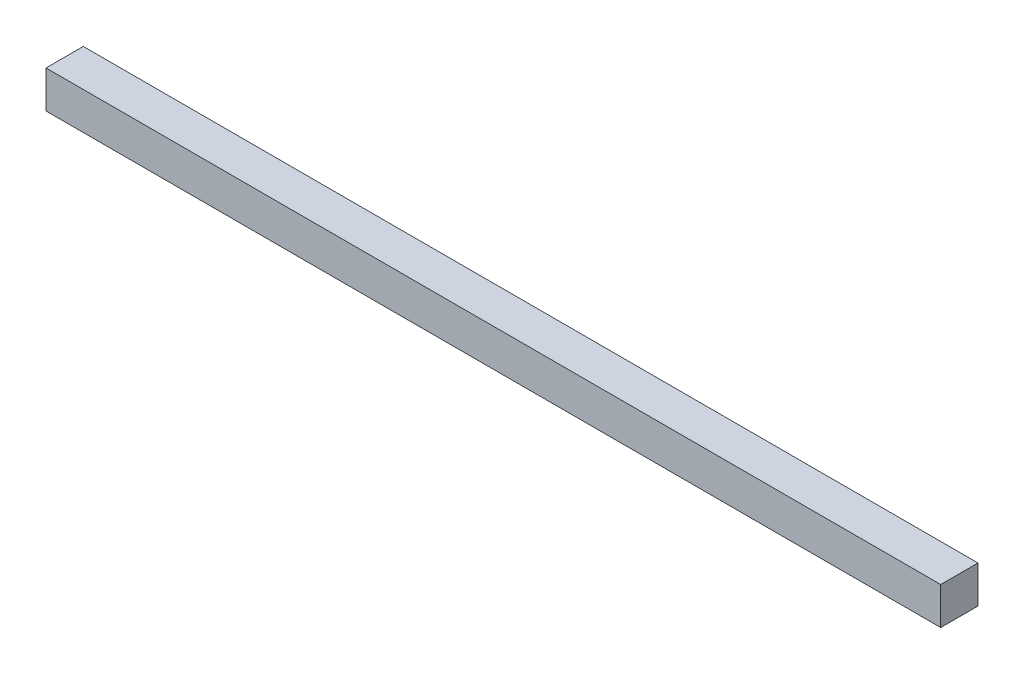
from build123d import *

# Parameters (mm, degrees)
SKETCH1_W           = 3.175
SKETCH1_H           = 3.175
BOSS_EXTRUDE1_DEPTH = 76.2


with BuildPart() as part:
    # Sketch1 → Boss-Extrude1 (new body)
    with BuildSketch(Plane(origin=(0, 0, 0), x_dir=(0, 0, -1), z_dir=(1, 0, 0))):
        with Locations((-1.5875, 1.5875)):
            Rectangle(SKETCH1_W, SKETCH1_H)
    extrude(amount=BOSS_EXTRUDE1_DEPTH)


solid = part.part
